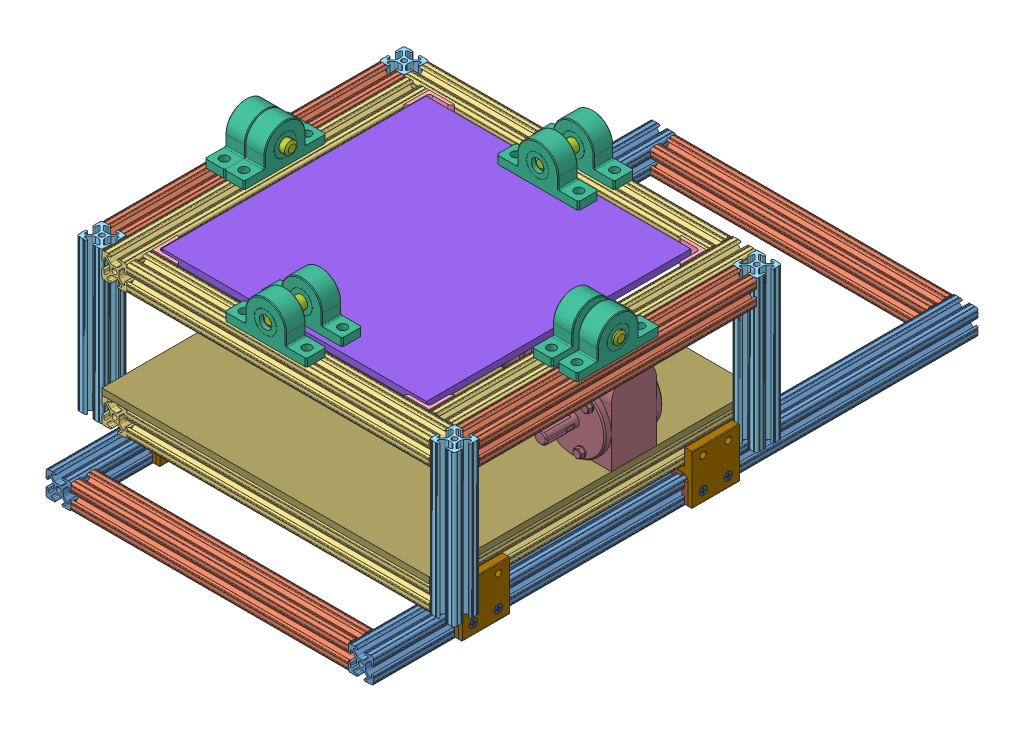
SolidWorks assembly Assem1.sldasm, configuration Default (file format 9000). Lengths in mm.
Overall size (383.98 227.77 609.6).
88 component instances, 13 part files, 11 mates.
Components (placement in the parent):
- 24ftbar-1: 24ftbar.sldprt [Default] at origin size (25.4 25.4 609.6)
- Beams11in-1: Beams11in.sldprt [Default] at (317.5 0 -12.7) x (0 0 -1) z (1 0 0) size (25.4 25.4 279.4)
- 24ftbar-2: 24ftbar.sldprt [Default] at (304.8 0 0) size (25.4 25.4 609.6)
- Beams11in-2: Beams11in.sldprt [Default] at (317.5 0 -596.9) x (0 0 -1) z (1 0 0) size (25.4 25.4 279.4)
- Platform doneishish-1: Platform doneishish.SLDASM [Default] at (-157.2163 -314.1895 -114.5711) x (0 0 -1) z (1 0 0) size (330.24 225.54 383.98)
  - Beams12in-4: Beams12in.sldprt [Default] at (271.7397 349.7495 462.1687) x (0 0 -1) z (1 0 0) size (25.4 25.4 304.8)
  - Beams12in-5: Beams12in.sldprt [Default] at (259.0397 349.7495 144.6687) x (-1 0 0) z (0 0 -1) size (25.4 25.4 304.8)
  - Beams12in-6: Beams12in.sldprt [Default] at (-45.7603 349.7495 170.0687) x (-1 0 0) z (0 0 -1) size (25.4 25.4 304.8)
  - Beams12in-7: Beams12in.sldprt [Default] at (246.3397 349.7495 157.3687) x (0 0 -1) z (1 0 0) size (25.4 25.4 304.8)
  - Corner bracket-1: Corner bracket.sldprt [Default] at (246.3397 349.7495 449.4687) x (0 -1 0) z (0 0 -1) size (25.4 25.4 25.4)
  - Corner bracket-2: Corner bracket.sldprt [Default] at (-33.0603 349.7495 170.0687) x (0 1 0) z (1 0 0) size (25.4 25.4 25.4)
  - Corner bracket-3: Corner bracket.sldprt [Default] at (246.3397 349.7495 170.0687) x (0 1 0) z (0 0 1) size (25.4 25.4 25.4)
  - Corner bracket-4: Corner bracket.sldprt [Default] at (-33.0603 349.7495 449.4687) x (0 -1 0) z (1 0 0) size (25.4 25.4 25.4)
  - Platform2-1: Platform2.SLDASM [Default] at (271.7213 476.6542 462.1369) x (0 0 -1) z (1 -0.000577 0) size (330.2 25.4 330.2)
    - Beams12in-7: Beams12in.sldprt [Default] at origin size (25.4 25.4 304.8)
    - Beams12in-5: Beams12in.sldprt [Default] at (317.5 0 -12.7) x (0 0 -1) z (1 0 0) size (25.4 25.4 304.8)
    - Beams12in-6: Beams12in.sldprt [Default] at (292.1 0 -317.5) x (0 0 -1) z (1 0 0) size (25.4 25.4 304.8)
    - Beams12in-8: Beams12in.sldprt [Default] at (304.8 0 -25.4) size (25.4 25.4 304.8)
    - Corner bracket-1: Corner bracket.sldprt [Default] at (12.7 0 -25.4) x (0 -1 0) z (1 0 0) size (25.4 25.4 25.4)
    - Corner bracket-2: Corner bracket.sldprt [Default] at (292.1 0 -304.8) x (0 1 0) z (0 0 1) size (25.4 25.4 25.4)
    - Corner bracket-3: Corner bracket.sldprt [Default] at (292.1 0 -25.4) x (0 1 0) z (-1 0 0) size (25.4 25.4 25.4)
    - Corner bracket-4: Corner bracket.sldprt [Default] at (12.7 0 -304.8) x (0 -1 0) z (0 0 1) size (25.4 25.4 25.4)
  - Beams6in-1: Beams6in.sldprt [Default] at (259.0397 184.6495 131.9687) x (0 0 -1) z (0 -1 0) size (25.4 25.4 152.4)
  - Beams6in-2: Beams6in.sldprt [Default] at (259.0397 184.6495 487.5687) x (0 0 -1) z (0 -1 0) size (25.4 25.4 152.4)
  - Sleeve bearing 05diameter-1: Sleeve bearing 05diameter.SLDPRT [2820T6] at (106.6397 508.4995 154.5588) x (-1 0.000577 0) z (0 0 -1) size (82.55 39.69 19.84)
  - Sleeve bearing 05diameter-2: Sleeve bearing 05diameter.SLDPRT [2820T6] at (106.6397 508.4995 464.915) x (1 -0.000577 0) z (0 0 1) size (82.55 39.69 19.84)
  - Beams6in-3: Beams6in.sldprt [Default] at (-45.7603 184.6495 131.9687) x (0 0 -1) z (0 -1 0) size (25.4 25.4 152.4)
  - Beams6in-4: Beams6in.sldprt [Default] at (-45.7603 184.6495 487.5687) x (0 0 -1) z (0 -1 0) size (25.4 25.4 152.4)
  - Beams11in-6: Beams11in.sldprt [Default] at (271.7397 476.7495 487.5687) x (0 0 -1) z (1 0 0) size (25.4 25.4 279.4)
  - Beams11in-7: Beams11in.sldprt [Default] at (271.7397 476.7495 131.9687) x (0 0 -1) z (1 0 0) size (25.4 25.4 279.4)
  - Sleeve bearing 05diameter-3: Sleeve bearing 05diameter.SLDPRT [2820T6] at (106.6397 508.4995 490.3468) x (-1 0 0) z (0 0 -1) size (82.55 39.69 19.84)
  - Sleeve bearing 05diameter-4: Sleeve bearing 05diameter.SLDPRT [2820T6] at (106.6397 508.4995 134.7468) x (-1 0 0) z (0 0 -1) size (82.55 39.69 19.84)
  - Rod-1: Rod.SLDPRT [Default] at (106.6397 508.4995 503.2532) x (0.451188 0.892429 0) z (0 0 -1) size (12.7 12.7 50.8)
  - Rod-2: Rod.SLDPRT [Default] at (106.6397 508.4995 171.5164) x (-0.988826 0.149076 0) z (0 0 -1) size (12.7 12.7 50.8)
  - Sleeve bearing 05diameter-5: Sleeve bearing 05diameter.SLDPRT [2820T6] at (261.8178 508.4099 309.7687) x (0 0 -1) z (1 -0.000577 0) size (82.55 39.69 19.84)
  - Sleeve bearing 05diameter-6: Sleeve bearing 05diameter.SLDPRT [2820T6] at (-48.5384 508.5891 309.7687) x (0 0 -1) z (1 -0.000577 0) size (82.55 39.69 19.84)
  - Sleeve bearing 05diameter-7: Sleeve bearing 05diameter.SLDPRT [2820T6] at (225.7815 508.4307 309.7687) x (0.000001 0.001168 -0.999999) z (1 -0.000577 0) size (82.55 39.69 19.84)
  - Sleeve bearing 05diameter-8: Sleeve bearing 05diameter.SLDPRT [2820T6] at (-12.5022 508.5683 309.7687) x (0.000001 0.001168 -0.999999) z (1 -0.000577 0) size (82.55 39.69 19.84)
  - Rod-3: Rod.SLDPRT [Default] at (218.3997 508.435 309.7687) x (0.000225 0.390504 -0.920601) z (1 -0.000577 0) size (12.7 12.7 50.8)
  - Rod-4: Rod.SLDPRT [Default] at (-55.9203 508.5933 309.7687) x (-0.000111 -0.191908 -0.981413) z (1 -0.000577 0) size (12.7 12.7 50.8)
  - Plate-1: Plate.SLDPRT [Default] at (106.0122 483.1026 307.3752) x (-0.000787 0.001168 -0.999999) z (1 -0.000576 -0.000788) size (266.7 6.35 266.7)
  - Linearbearing-1: Linearbearing.sldasm [Default] at (222.5272 314.0371 462.1687) x (0 0 -1) z (1 0 0) size (41.25 49.99 47.63)
    - _6715_p_2-1: _6715_p_2.sldprt [Default] at origin size (41.25 49.99 47.63)
    - _3625__4-1: _3625__4.sldprt [Default] at (-18.973 0 12.6873) x (0 0 -1) z (0 -1 0) size (8.43 1.79 8.43)
    - _3625__4-2: _3625__4.sldprt [Default] at (-18.973 0 -12.7127) x (0 0 -1) z (0 -1 0) size (8.43 1.79 8.43)
    - _3625__4-3: _3625__4.sldprt [Default] at (18.973 0 12.6873) x (0 0 -1) z (0 1 0) size (8.43 1.79 8.43)
    - _3625__4-4: _3625__4.sldprt [Default] at (18.973 0 -12.7127) x (0 0 -1) z (0 1 0) size (8.43 1.79 8.43)
    - _3625__4-5: _3625__4.sldprt [Default] at (0 19.5826 12.6873) x (1 0 0) z (0 0 -1) size (8.43 1.79 8.43)
    - _3625__4-6: _3625__4.sldprt [Default] at (0 19.5826 -12.7127) x (1 0 0) z (0 0 -1) size (8.43 1.79 8.43)
    - _6790_11-1: _6790_11.sldprt [Default] at (-12.8524 0 -0.0254) x (0 0 -1) z (1 0 0) size (47.37 20.62 6.35)
    - _6790_11-2: _6790_11.sldprt [Default] at (12.8524 0 -0.0254) x (0 0 -1) z (-1 0 0) size (47.37 20.62 6.35)
    - _6790_11-3: _6790_11.sldprt [Default] at (0 12.8524 -0.0254) x (0 0 -1) z (0 -1 0) size (47.37 20.62 6.35)
  - Linearbearing-2: Linearbearing.sldasm [Default] at (-9.2478 314.0371 462.1687) x (0 0 -1) z (1 0 0) size (41.25 49.99 47.63)
    - _6715_p_2-1: _6715_p_2.sldprt [Default] at origin size (41.25 49.99 47.63)
    - _3625__4-1: _3625__4.sldprt [Default] at (-18.973 0 12.6873) x (0 0 -1) z (0 -1 0) size (8.43 1.79 8.43)
    - _3625__4-2: _3625__4.sldprt [Default] at (-18.973 0 -12.7127) x (0 0 -1) z (0 -1 0) size (8.43 1.79 8.43)
    - _3625__4-3: _3625__4.sldprt [Default] at (18.973 0 12.6873) x (0 0 -1) z (0 1 0) size (8.43 1.79 8.43)
    - _3625__4-4: _3625__4.sldprt [Default] at (18.973 0 -12.7127) x (0 0 -1) z (0 1 0) size (8.43 1.79 8.43)
    - _3625__4-5: _3625__4.sldprt [Default] at (0 19.5826 12.6873) x (1 0 0) z (0 0 -1) size (8.43 1.79 8.43)
    - _3625__4-6: _3625__4.sldprt [Default] at (0 19.5826 -12.7127) x (1 0 0) z (0 0 -1) size (8.43 1.79 8.43)
    - _6790_11-1: _6790_11.sldprt [Default] at (-12.8524 0 -0.0254) x (0 0 -1) z (1 0 0) size (47.37 20.62 6.35)
    - _6790_11-2: _6790_11.sldprt [Default] at (12.8524 0 -0.0254) x (0 0 -1) z (-1 0 0) size (47.37 20.62 6.35)
    - _6790_11-3: _6790_11.sldprt [Default] at (0 12.8524 -0.0254) x (0 0 -1) z (0 -1 0) size (47.37 20.62 6.35)
  - Linearbearing-3: Linearbearing.sldasm [Default] at (-9.2478 314.0371 157.3687) x (0 0 1) z (-1 0 0) size (41.25 49.99 47.63)
    - _6715_p_2-1: _6715_p_2.sldprt [Default] at origin size (41.25 49.99 47.63)
    - _3625__4-1: _3625__4.sldprt [Default] at (-18.973 0 12.6873) x (0 0 -1) z (0 -1 0) size (8.43 1.79 8.43)
    - _3625__4-2: _3625__4.sldprt [Default] at (-18.973 0 -12.7127) x (0 0 -1) z (0 -1 0) size (8.43 1.79 8.43)
    - _3625__4-3: _3625__4.sldprt [Default] at (18.973 0 12.6873) x (0 0 -1) z (0 1 0) size (8.43 1.79 8.43)
    - _3625__4-4: _3625__4.sldprt [Default] at (18.973 0 -12.7127) x (0 0 -1) z (0 1 0) size (8.43 1.79 8.43)
    - _3625__4-5: _3625__4.sldprt [Default] at (0 19.5826 12.6873) x (1 0 0) z (0 0 -1) size (8.43 1.79 8.43)
    - _3625__4-6: _3625__4.sldprt [Default] at (0 19.5826 -12.7127) x (1 0 0) z (0 0 -1) size (8.43 1.79 8.43)
    - _6790_11-1: _6790_11.sldprt [Default] at (-12.8524 0 -0.0254) x (0 0 -1) z (1 0 0) size (47.37 20.62 6.35)
    - _6790_11-2: _6790_11.sldprt [Default] at (12.8524 0 -0.0254) x (0 0 -1) z (-1 0 0) size (47.37 20.62 6.35)
    - _6790_11-3: _6790_11.sldprt [Default] at (0 12.8524 -0.0254) x (0 0 -1) z (0 -1 0) size (47.37 20.62 6.35)
  - Linearbearing-4: Linearbearing.sldasm [Default] at (222.5272 314.0371 157.3687) x (0 0 1) z (-1 0 0) size (41.25 49.99 47.63)
    - _6715_p_2-1: _6715_p_2.sldprt [Default] at origin size (41.25 49.99 47.63)
    - _3625__4-1: _3625__4.sldprt [Default] at (-18.973 0 12.6873) x (0 0 -1) z (0 -1 0) size (8.43 1.79 8.43)
    - _3625__4-2: _3625__4.sldprt [Default] at (-18.973 0 -12.7127) x (0 0 -1) z (0 -1 0) size (8.43 1.79 8.43)
    - _3625__4-3: _3625__4.sldprt [Default] at (18.973 0 12.6873) x (0 0 -1) z (0 1 0) size (8.43 1.79 8.43)
    - _3625__4-4: _3625__4.sldprt [Default] at (18.973 0 -12.7127) x (0 0 -1) z (0 1 0) size (8.43 1.79 8.43)
    - _3625__4-5: _3625__4.sldprt [Default] at (0 19.5826 12.6873) x (1 0 0) z (0 0 -1) size (8.43 1.79 8.43)
    - _3625__4-6: _3625__4.sldprt [Default] at (0 19.5826 -12.7127) x (1 0 0) z (0 0 -1) size (8.43 1.79 8.43)
    - _6790_11-1: _6790_11.sldprt [Default] at (-12.8524 0 -0.0254) x (0 0 -1) z (1 0 0) size (47.37 20.62 6.35)
    - _6790_11-2: _6790_11.sldprt [Default] at (12.8524 0 -0.0254) x (0 0 -1) z (-1 0 0) size (47.37 20.62 6.35)
    - _6790_11-3: _6790_11.sldprt [Default] at (0 12.8524 -0.0254) x (0 0 -1) z (0 -1 0) size (47.37 20.62 6.35)
  - bottom plate-1: bottom plate.SLDPRT [Default] at (106.6397 362.4495 309.7687) size (330.2 6.35 330.2)
  - 59825K310_RIGHT-ANGLE SHAFT DC GEARMOTOR-1: 59825K310_RIGHT-ANGLE SHAFT DC GEARMOTOR.SLDPRT [59825K31] at (179.5377 427.2195 181.3098) size (223.17 90.17 100.08)
  - 59825K310_RIGHT-ANGLE SHAFT DC GEARMOTOR-2: 59825K310_RIGHT-ANGLE SHAFT DC GEARMOTOR.SLDPRT [59825K31] at (148.0409 427.2195 382.6667) x (0 0 1) z (-1 0 0) size (223.17 90.17 100.08)
Mates (geometry in assembly coordinates):
- Coincident1: coincident aligned: plane of 24ftbar-1 through (-12.7 -10.0584 0) normal (0 0 1); plane of Beams11in-1 through (12.7 9.5504 0) normal (0 0 1)
- Coincident2: coincident anti-aligned: plane of 24ftbar-1 through (12.7 6.3331 -609.6) normal (1 0 0); plane of Beams11in-1 through (12.7 -10.0584 0) normal (-1 0 0)
- Coincident3: coincident aligned: plane of 24ftbar-1 through (9.5504 12.7 -609.6) normal (0 1 0); plane of Beams11in-1 through (12.7 12.7 -22.2504) normal (0 1 0)
- Coincident4: coincident aligned: plane of Beams11in-1 through (12.7 9.5504 0) normal (0 0 1); plane of 24ftbar-2 through (292.1 -10.0584 0) normal (0 0 1)
- Coincident5: coincident aligned: plane of Beams11in-1 through (12.7 12.7 -22.2504) normal (0 1 0); plane of 24ftbar-2 through (298.4669 12.7 -609.6) normal (0 1 0)
- Coincident6: coincident anti-aligned: plane of Beams11in-1 through (292.1 0 -12.7) normal (1 0 0); plane of 24ftbar-2 through (292.1 -6.3331 -609.6) normal (-1 0 0)
- Coincident7: coincident anti-aligned: plane of 24ftbar-2 through (292.1 9.5504 -609.6) normal (-1 0 0); plane of Beams11in-2 through (292.1 0 -596.9) normal (1 0 0)
- Coincident8: coincident aligned: plane of 24ftbar-2 through (298.4669 12.7 -609.6) normal (0 1 0); plane of Beams11in-2 through (12.7 12.7 -590.5669) normal (0 1 0)
- Coincident9: coincident aligned: plane of 24ftbar-2 through (292.1 -10.0584 -609.6) normal (0 0 -1); plane of Beams11in-2 through (12.7 6.3331 -609.6) normal (0 0 -1)
- Coincident10: coincident anti-aligned: plane of 24ftbar-2 through (292.1 9.5504 -609.6) normal (-1 0 0); plane of Platform doneishish-1/Linearbearing-2/_6790_11-2 through (292.1 3.0226 -81.6124) normal (1 0 0)
- Coincident11: coincident anti-aligned: plane of 24ftbar-2 through (314.3504 12.7 -609.6) normal (0 1 0); plane of Platform doneishish-1/Linearbearing-2/_6790_11-3 through (308.1274 12.7 -81.6124) normal (0 -1 0)
